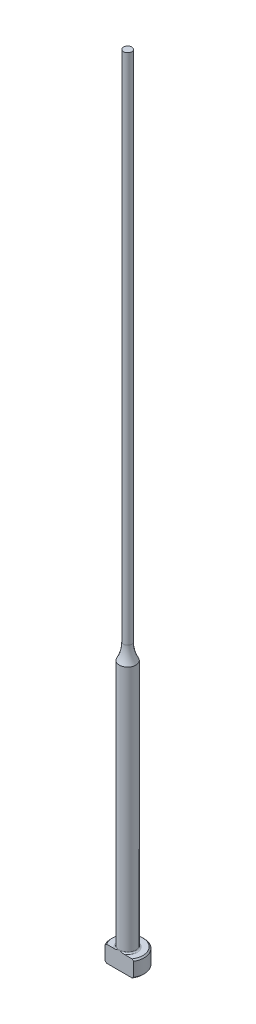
ISO-10303-21;
HEADER;
FILE_DESCRIPTION(('STEP AP214'),'2;1');
FILE_NAME('part.step','',(''),(''),'','','');
FILE_SCHEMA(('AUTOMOTIVE_DESIGN { 1 0 10303 214 1 1 1 1 }'));
ENDSEC;
DATA;
#1=APPLICATION_CONTEXT('core data for automotive mechanical design processes');
#2=APPLICATION_PROTOCOL_DEFINITION('international standard','automotive_design',2000,#1);
#3=PRODUCT_CONTEXT('',#1,'mechanical');
#4=PRODUCT('Part','Part','',(#3));
#5=PRODUCT_RELATED_PRODUCT_CATEGORY('part','',(#4));
#6=PRODUCT_DEFINITION_FORMATION('','',#4);
#7=PRODUCT_DEFINITION_CONTEXT('part definition',#1,'design');
#8=PRODUCT_DEFINITION('design','',#6,#7);
#9=PRODUCT_DEFINITION_SHAPE('','',#8);
#10=(LENGTH_UNIT() NAMED_UNIT(*) SI_UNIT(.MILLI.,.METRE.));
#11=(NAMED_UNIT(*) PLANE_ANGLE_UNIT() SI_UNIT($,.RADIAN.));
#12=(NAMED_UNIT(*) SI_UNIT($,.STERADIAN.) SOLID_ANGLE_UNIT());
#13=UNCERTAINTY_MEASURE_WITH_UNIT(LENGTH_MEASURE(1.E-05),#10,'distance_accuracy_value','');
#14=(GEOMETRIC_REPRESENTATION_CONTEXT(3) GLOBAL_UNCERTAINTY_ASSIGNED_CONTEXT((#13)) GLOBAL_UNIT_ASSIGNED_CONTEXT((#10,
#11,#12)) REPRESENTATION_CONTEXT('',''));
#15=CARTESIAN_POINT('',(0.,0.,0.));
#16=DIRECTION('',(0.,0.,1.));
#17=DIRECTION('',(1.,0.,0.));
#18=AXIS2_PLACEMENT_3D('',#15,#16,#17);
#19=CARTESIAN_POINT('',(-0.793749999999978,152.4,0.));
#20=DIRECTION('',(0.,1.,0.));
#21=DIRECTION('',(0.,0.,1.));
#22=AXIS2_PLACEMENT_3D('',#19,#20,#21);
#23=PLANE('',#22);
#24=CARTESIAN_POINT('',(0.,152.4,0.));
#25=DIRECTION('',(0.,1.,0.));
#26=DIRECTION('',(0.,0.,1.));
#27=AXIS2_PLACEMENT_3D('',#24,#25,#26);
#28=CIRCLE('',#27,0.793749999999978);
#29=CARTESIAN_POINT('',(0.,152.4,0.793749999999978));
#30=VERTEX_POINT('',#29);
#31=EDGE_CURVE('E169',#30,#30,#28,.T.);
#32=ORIENTED_EDGE('',*,*,#31,.T.);
#33=EDGE_LOOP('',(#32));
#34=FACE_BOUND('',#33,.T.);
#35=ADVANCED_FACE('F37',(#34),#23,.T.);
#36=CARTESIAN_POINT('',(0.,259.958771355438,0.));
#37=DIRECTION('',(0.,1.,0.));
#38=DIRECTION('',(0.,0.,1.));
#39=AXIS2_PLACEMENT_3D('',#36,#37,#38);
#40=CYLINDRICAL_SURFACE('',#39,0.793749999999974);
#41=CARTESIAN_POINT('',(0.,53.8741805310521,0.));
#42=DIRECTION('',(0.,1.,0.));
#43=DIRECTION('',(0.,0.,1.));
#44=AXIS2_PLACEMENT_3D('',#41,#42,#43);
#45=CIRCLE('',#44,0.79374999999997);
#46=CARTESIAN_POINT('',(0.,53.8741805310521,0.79374999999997));
#47=VERTEX_POINT('',#46);
#48=EDGE_CURVE('E172',#47,#47,#45,.T.);
#49=ORIENTED_EDGE('',*,*,#48,.T.);
#50=EDGE_LOOP('',(#49));
#51=FACE_BOUND('',#50,.T.);
#52=ORIENTED_EDGE('',*,*,#31,.F.);
#53=EDGE_LOOP('',(#52));
#54=FACE_BOUND('',#53,.T.);
#55=ADVANCED_FACE('F160',(#51,#54),#40,.T.);
#56=CARTESIAN_POINT('',(0.,53.8741805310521,0.));
#57=DIRECTION('',(0.,1.,0.));
#58=DIRECTION('',(0.,0.,1.));
#59=AXIS2_PLACEMENT_3D('',#56,#57,#58);
#60=TOROIDAL_SURFACE('',#59,7.14374999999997,6.35);
#61=CARTESIAN_POINT('',(0.,50.8,0.));
#62=DIRECTION('',(0.,1.,0.));
#63=DIRECTION('',(0.,0.,1.));
#64=AXIS2_PLACEMENT_3D('',#61,#62,#63);
#65=CIRCLE('',#64,1.58749999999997);
#66=CARTESIAN_POINT('',(0.,50.8,1.58749999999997));
#67=VERTEX_POINT('',#66);
#68=EDGE_CURVE('E100',#67,#67,#65,.T.);
#69=ORIENTED_EDGE('',*,*,#68,.T.);
#70=EDGE_LOOP('',(#69));
#71=FACE_BOUND('',#70,.T.);
#72=ORIENTED_EDGE('',*,*,#48,.F.);
#73=EDGE_LOOP('',(#72));
#74=FACE_BOUND('',#73,.T.);
#75=ADVANCED_FACE('F165',(#71,#74),#60,.F.);
#76=CARTESIAN_POINT('',(0.,259.958771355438,0.));
#77=DIRECTION('',(0.,1.,0.));
#78=DIRECTION('',(0.,0.,1.));
#79=AXIS2_PLACEMENT_3D('',#76,#77,#78);
#80=CYLINDRICAL_SURFACE('',#79,1.58749999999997);
#81=CARTESIAN_POINT('',(0.,3.42900000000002,0.));
#82=DIRECTION('',(0.,1.,0.));
#83=DIRECTION('',(0.,0.,1.));
#84=AXIS2_PLACEMENT_3D('',#81,#82,#83);
#85=CIRCLE('',#84,1.58749999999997);
#86=CARTESIAN_POINT('',(0.,3.42900000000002,1.58749999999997));
#87=VERTEX_POINT('',#86);
#88=EDGE_CURVE('E109',#87,#87,#85,.T.);
#89=ORIENTED_EDGE('',*,*,#88,.T.);
#90=EDGE_LOOP('',(#89));
#91=FACE_BOUND('',#90,.T.);
#92=ORIENTED_EDGE('',*,*,#68,.F.);
#93=EDGE_LOOP('',(#92));
#94=FACE_BOUND('',#93,.T.);
#95=ADVANCED_FACE('F192',(#91,#94),#80,.T.);
#96=CARTESIAN_POINT('',(-3.17499999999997,3.175,0.));
#97=DIRECTION('',(0.,1.,0.));
#98=DIRECTION('',(0.,0.,1.));
#99=AXIS2_PLACEMENT_3D('',#96,#97,#98);
#100=PLANE('',#99);
#101=DIRECTION('',(-1.,0.,0.));
#102=VECTOR('',#101,1.);
#103=CARTESIAN_POINT('',(-3.17499999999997,3.175,1.58749999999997));
#104=LINE('',#103,#102);
#105=CARTESIAN_POINT('',(2.45195529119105,3.175,1.58749999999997));
#106=VERTEX_POINT('',#105);
#107=CARTESIAN_POINT('',(0.933255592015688,3.175,1.58749999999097));
#108=VERTEX_POINT('',#107);
#109=EDGE_CURVE('E58',#106,#108,#104,.T.);
#110=ORIENTED_EDGE('',*,*,#109,.F.);
#111=CARTESIAN_POINT('',(0.,3.175,0.));
#112=DIRECTION('',(0.,1.,0.));
#113=DIRECTION('',(0.,0.,1.));
#114=AXIS2_PLACEMENT_3D('',#111,#112,#113);
#115=CIRCLE('',#114,2.92099999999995);
#116=CARTESIAN_POINT('',(-2.45195529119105,3.175,1.58749999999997));
#117=VERTEX_POINT('',#116);
#118=EDGE_CURVE('E171',#106,#117,#115,.T.);
#119=ORIENTED_EDGE('',*,*,#118,.T.);
#120=CARTESIAN_POINT('',(-0.933255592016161,3.17500000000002,1.58749999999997));
#121=VERTEX_POINT('',#120);
#122=EDGE_CURVE('E140',#121,#117,#104,.T.);
#123=ORIENTED_EDGE('',*,*,#122,.F.);
#124=CARTESIAN_POINT('',(0.,3.175,0.));
#125=DIRECTION('',(0.,1.,0.));
#126=DIRECTION('',(0.,0.,1.));
#127=AXIS2_PLACEMENT_3D('',#124,#125,#126);
#128=CIRCLE('',#127,1.84149999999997);
#129=EDGE_CURVE('E113',#121,#108,#128,.F.);
#130=ORIENTED_EDGE('',*,*,#129,.T.);
#131=EDGE_LOOP('',(#110,#119,#123,#130));
#132=FACE_BOUND('',#131,.T.);
#133=ADVANCED_FACE('F189',(#132),#100,.T.);
#134=CARTESIAN_POINT('',(0.,259.958771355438,0.));
#135=DIRECTION('',(0.,1.,0.));
#136=DIRECTION('',(0.,0.,1.));
#137=AXIS2_PLACEMENT_3D('',#134,#135,#136);
#138=CYLINDRICAL_SURFACE('',#137,3.17499999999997);
#139=DIRECTION('',(0.,-1.,0.));
#140=VECTOR('',#139,1.);
#141=CARTESIAN_POINT('',(-2.74963065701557,152.4,1.58749999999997));
#142=LINE('',#141,#140);
#143=CARTESIAN_POINT('',(-2.74963065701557,2.921,1.58749999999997));
#144=VERTEX_POINT('',#143);
#145=CARTESIAN_POINT('',(-2.74963065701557,0.254000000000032,1.58749999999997));
#146=VERTEX_POINT('',#145);
#147=EDGE_CURVE('E95',#144,#146,#142,.T.);
#148=ORIENTED_EDGE('',*,*,#147,.F.);
#149=CARTESIAN_POINT('',(0.,2.92100000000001,0.));
#150=DIRECTION('',(0.,1.,0.));
#151=DIRECTION('',(0.,0.,1.));
#152=AXIS2_PLACEMENT_3D('',#149,#150,#151);
#153=CIRCLE('',#152,3.17499999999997);
#154=CARTESIAN_POINT('',(2.74963065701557,2.921,1.58749999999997));
#155=VERTEX_POINT('',#154);
#156=EDGE_CURVE('E110',#144,#155,#153,.F.);
#157=ORIENTED_EDGE('',*,*,#156,.T.);
#158=DIRECTION('',(0.,-1.,0.));
#159=VECTOR('',#158,1.);
#160=CARTESIAN_POINT('',(2.74963065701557,152.4,1.58749999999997));
#161=LINE('',#160,#159);
#162=CARTESIAN_POINT('',(2.74963065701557,0.254000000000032,1.58749999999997));
#163=VERTEX_POINT('',#162);
#164=EDGE_CURVE('E182',#155,#163,#161,.T.);
#165=ORIENTED_EDGE('',*,*,#164,.T.);
#166=CARTESIAN_POINT('',(0.,0.254000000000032,0.));
#167=DIRECTION('',(0.,-1.,0.));
#168=DIRECTION('',(0.,0.,-1.));
#169=AXIS2_PLACEMENT_3D('',#166,#167,#168);
#170=CIRCLE('',#169,3.17499999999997);
#171=EDGE_CURVE('E116',#163,#146,#170,.F.);
#172=ORIENTED_EDGE('',*,*,#171,.T.);
#173=EDGE_LOOP('',(#148,#157,#165,#172));
#174=FACE_BOUND('',#173,.T.);
#175=ADVANCED_FACE('F180',(#174),#138,.T.);
#176=CARTESIAN_POINT('',(0.,0.,0.));
#177=DIRECTION('',(0.,-1.,0.));
#178=DIRECTION('',(0.,0.,-1.));
#179=AXIS2_PLACEMENT_3D('',#176,#177,#178);
#180=PLANE('',#179);
#181=DIRECTION('',(1.,0.,0.));
#182=VECTOR('',#181,1.);
#183=CARTESIAN_POINT('',(-2.74963065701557,0.,1.58749999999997));
#184=LINE('',#183,#182);
#185=CARTESIAN_POINT('',(-2.45195529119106,0.,1.58749999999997));
#186=VERTEX_POINT('',#185);
#187=CARTESIAN_POINT('',(2.45195529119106,0.,1.58749999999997));
#188=VERTEX_POINT('',#187);
#189=EDGE_CURVE('E92',#186,#188,#184,.T.);
#190=ORIENTED_EDGE('',*,*,#189,.F.);
#191=CARTESIAN_POINT('',(0.,0.,0.));
#192=DIRECTION('',(0.,-1.,0.));
#193=DIRECTION('',(0.,0.,-1.));
#194=AXIS2_PLACEMENT_3D('',#191,#192,#193);
#195=CIRCLE('',#194,2.92099999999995);
#196=EDGE_CURVE('E106',#186,#188,#195,.T.);
#197=ORIENTED_EDGE('',*,*,#196,.T.);
#198=EDGE_LOOP('',(#190,#197));
#199=FACE_BOUND('',#198,.T.);
#200=ADVANCED_FACE('F105',(#199),#180,.T.);
#201=CARTESIAN_POINT('',(0.,3.17499999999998,0.));
#202=DIRECTION('',(0.,-1.,0.));
#203=DIRECTION('',(0.,0.,-1.));
#204=AXIS2_PLACEMENT_3D('',#201,#202,#203);
#205=CONICAL_SURFACE('',#204,2.92099999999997,0.7853981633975);
#206=CARTESIAN_POINT('',(2.75033065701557,2.9203937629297,1.58749999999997));
#207=CARTESIAN_POINT('',(2.66887796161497,2.99091042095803,1.58749999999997));
#208=CARTESIAN_POINT('',(2.58705989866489,3.0610138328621,1.58749999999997));
#209=CARTESIAN_POINT('',(2.42241022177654,3.20009957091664,1.58749999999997));
#210=CARTESIAN_POINT('',(2.33957813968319,3.26908134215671,1.58749999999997));
#211=CARTESIAN_POINT('',(2.17073968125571,3.40716024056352,1.58749999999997));
#212=CARTESIAN_POINT('',(2.08470440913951,3.47622217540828,1.58749999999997));
#213=CARTESIAN_POINT('',(1.91099881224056,3.61222325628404,1.58749999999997));
#214=CARTESIAN_POINT('',(1.82332890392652,3.67916293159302,1.58749999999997));
#215=CARTESIAN_POINT('',(1.64569223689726,3.81020667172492,1.58749999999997));
#216=CARTESIAN_POINT('',(1.55572245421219,3.87430666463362,1.58749999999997));
#217=CARTESIAN_POINT('',(1.37280394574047,3.99833089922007,1.58749999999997));
#218=CARTESIAN_POINT('',(1.27985285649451,4.05825170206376,1.58749999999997));
#219=CARTESIAN_POINT('',(1.09086561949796,4.17130826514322,1.58749999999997));
#220=CARTESIAN_POINT('',(0.99485990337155,4.22449421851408,1.58749999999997));
#221=CARTESIAN_POINT('',(0.798114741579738,4.32122233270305,1.58749999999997));
#222=CARTESIAN_POINT('',(0.697384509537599,4.36478238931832,1.58749999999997));
#223=CARTESIAN_POINT('',(0.541185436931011,4.4195165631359,1.58749999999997));
#224=CARTESIAN_POINT('',(0.487627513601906,4.43611950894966,1.58749999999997));
#225=CARTESIAN_POINT('',(0.379267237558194,4.46466012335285,1.58749999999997));
#226=CARTESIAN_POINT('',(0.324465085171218,4.47659853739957,1.58749999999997));
#227=CARTESIAN_POINT('',(0.214272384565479,4.49501904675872,1.58749999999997));
#228=CARTESIAN_POINT('',(0.158887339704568,4.50153345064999,1.58749999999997));
#229=CARTESIAN_POINT('',(0.0477364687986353,4.50875028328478,1.58749999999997));
#230=CARTESIAN_POINT('',(-0.00802931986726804,4.50945327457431,1.58749999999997));
#231=CARTESIAN_POINT('',(-0.119372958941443,4.50499163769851,1.58749999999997));
#232=CARTESIAN_POINT('',(-0.174950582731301,4.49982147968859,1.58749999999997));
#233=CARTESIAN_POINT('',(-0.285312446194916,4.48399101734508,1.58749999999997));
#234=CARTESIAN_POINT('',(-0.340096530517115,4.47332965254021,1.58749999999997));
#235=CARTESIAN_POINT('',(-0.448865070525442,4.44711334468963,1.58749999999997));
#236=CARTESIAN_POINT('',(-0.50284128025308,4.43152477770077,1.58749999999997));
#237=CARTESIAN_POINT('',(-0.609429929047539,4.39628553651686,1.58749999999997));
#238=CARTESIAN_POINT('',(-0.66204236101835,4.3766348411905,1.58749999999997));
#239=CARTESIAN_POINT('',(-0.778129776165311,4.32902110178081,1.58749999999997));
#240=CARTESIAN_POINT('',(-0.84124591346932,4.30019026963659,1.58749999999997));
#241=CARTESIAN_POINT('',(-0.965594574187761,4.23868811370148,1.58749999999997));
#242=CARTESIAN_POINT('',(-1.02682597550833,4.20601455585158,1.58749999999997));
#243=CARTESIAN_POINT('',(-1.14774341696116,4.13769010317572,1.58749999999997));
#244=CARTESIAN_POINT('',(-1.20742632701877,4.10203371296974,1.58749999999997));
#245=CARTESIAN_POINT('',(-1.32539130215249,4.02846531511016,1.58749999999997));
#246=CARTESIAN_POINT('',(-1.38367308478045,3.9905528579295,1.58749999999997));
#247=CARTESIAN_POINT('',(-1.55734442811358,3.87382704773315,1.58749999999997));
#248=CARTESIAN_POINT('',(-1.67095842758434,3.79237897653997,1.58749999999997));
#249=CARTESIAN_POINT('',(-1.8947523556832,3.6252186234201,1.58749999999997));
#250=CARTESIAN_POINT('',(-2.00493591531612,3.53951111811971,1.58749999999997));
#251=CARTESIAN_POINT('',(-2.22248693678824,3.3655494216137,1.58749999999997));
#252=CARTESIAN_POINT('',(-2.32986450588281,3.27730782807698,1.58749999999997));
#253=CARTESIAN_POINT('',(-2.48909538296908,3.14389342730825,1.58749999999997));
#254=CARTESIAN_POINT('',(-2.54159338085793,3.09948435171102,1.58749999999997));
#255=CARTESIAN_POINT('',(-2.64622282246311,3.01024124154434,1.58749999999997));
#256=CARTESIAN_POINT('',(-2.69835428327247,2.96540722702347,1.58749999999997));
#257=CARTESIAN_POINT('',(-2.75033065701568,2.92039376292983,1.58749999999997));
#258=B_SPLINE_CURVE_WITH_KNOTS('',3,(#206,#207,#208,#209,#210,#211,#212,#213,#214,#215,#216,
#217,#218,#219,#220,#221,#222,#223,#224,#225,#226,#227,#228,#229,#230,#231,#232,#233,#234,#235,
#236,#237,#238,#239,#240,#241,#242,#243,#244,#245,#246,#247,#248,#249,#250,#251,#252,#253,#254,
#255,#256,#257),.UNSPECIFIED.,.F.,.F.,(4,2,2,2,2,2,2,2,2,2,2,2,2,2,2,2,2,2,2,2,2,2,2,2,2,4),(0.,
0.323216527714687,0.64658837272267,0.977539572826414,1.30840757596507,1.63973560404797,
1.97133312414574,2.30029221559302,2.62863448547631,2.79668277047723,2.9647041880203,
3.13171746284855,3.29871457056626,3.46586904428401,3.63305581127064,3.80140905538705,
3.96976317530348,4.17775353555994,4.38586541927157,4.59436953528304,4.80291533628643,
5.22209642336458,5.64081759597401,6.0577303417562,6.26401477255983,6.47028951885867),.UNSPECIFIED.);
#259=EDGE_CURVE('E63',#155,#106,#258,.T.);
#260=ORIENTED_EDGE('',*,*,#259,.F.);
#261=ORIENTED_EDGE('',*,*,#156,.F.);
#262=EDGE_CURVE('E133',#117,#144,#258,.T.);
#263=ORIENTED_EDGE('',*,*,#262,.F.);
#264=ORIENTED_EDGE('',*,*,#118,.F.);
#265=EDGE_LOOP('',(#260,#261,#263,#264));
#266=FACE_BOUND('',#265,.T.);
#267=ADVANCED_FACE('F147',(#266),#205,.T.);
#268=CARTESIAN_POINT('',(0.,0.254000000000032,0.));
#269=DIRECTION('',(0.,1.,0.));
#270=DIRECTION('',(0.,0.,1.));
#271=AXIS2_PLACEMENT_3D('',#268,#269,#270);
#272=CONICAL_SURFACE('',#271,3.17499999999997,0.785398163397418);
#273=CARTESIAN_POINT('',(-2.75033065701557,0.254606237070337,1.58749999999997));
#274=CARTESIAN_POINT('',(-2.66887796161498,0.184089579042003,1.58749999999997));
#275=CARTESIAN_POINT('',(-2.58705989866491,0.113986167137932,1.58749999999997));
#276=CARTESIAN_POINT('',(-2.42241022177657,-0.0250995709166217,1.58749999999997));
#277=CARTESIAN_POINT('',(-2.33957813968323,-0.0940813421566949,1.58749999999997));
#278=CARTESIAN_POINT('',(-2.17073968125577,-0.232160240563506,1.58749999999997));
#279=CARTESIAN_POINT('',(-2.08470440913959,-0.301222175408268,1.58749999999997));
#280=CARTESIAN_POINT('',(-1.91099881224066,-0.437223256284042,1.58749999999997));
#281=CARTESIAN_POINT('',(-1.82332890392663,-0.504162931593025,1.58749999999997));
#282=CARTESIAN_POINT('',(-1.64569223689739,-0.635206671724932,1.58749999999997));
#283=CARTESIAN_POINT('',(-1.55572245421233,-0.699306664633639,1.58749999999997));
#284=CARTESIAN_POINT('',(-1.37280394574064,-0.8233308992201,1.58749999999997));
#285=CARTESIAN_POINT('',(-1.27985285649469,-0.883251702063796,1.58749999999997));
#286=CARTESIAN_POINT('',(-1.09086561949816,-0.996308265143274,1.58749999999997));
#287=CARTESIAN_POINT('',(-0.994859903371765,-1.04949421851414,1.58749999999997));
#288=CARTESIAN_POINT('',(-0.798114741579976,-1.14622233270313,1.58749999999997));
#289=CARTESIAN_POINT('',(-0.697384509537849,-1.18978238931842,1.58749999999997));
#290=CARTESIAN_POINT('',(-0.54118543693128,-1.24451656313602,1.58749999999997));
#291=CARTESIAN_POINT('',(-0.487627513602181,-1.26111950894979,1.58749999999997));
#292=CARTESIAN_POINT('',(-0.379267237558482,-1.28966012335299,1.58749999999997));
#293=CARTESIAN_POINT('',(-0.324465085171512,-1.30159853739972,1.58749999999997));
#294=CARTESIAN_POINT('',(-0.214272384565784,-1.3200190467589,1.58749999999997));
#295=CARTESIAN_POINT('',(-0.158887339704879,-1.32653345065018,1.58749999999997));
#296=CARTESIAN_POINT('',(-0.0477364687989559,-1.33375028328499,1.58749999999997));
#297=CARTESIAN_POINT('',(0.00802931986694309,-1.33445327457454,1.58749999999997));
#298=CARTESIAN_POINT('',(0.119372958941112,-1.32999163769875,1.58749999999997));
#299=CARTESIAN_POINT('',(0.174950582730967,-1.32482147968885,1.58749999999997));
#300=CARTESIAN_POINT('',(0.28531244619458,-1.30899101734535,1.58749999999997));
#301=CARTESIAN_POINT('',(0.340096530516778,-1.2983296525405,1.58749999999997));
#302=CARTESIAN_POINT('',(0.448865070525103,-1.27211334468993,1.58749999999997));
#303=CARTESIAN_POINT('',(0.50284128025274,-1.25652477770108,1.58749999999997));
#304=CARTESIAN_POINT('',(0.609429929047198,-1.22128553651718,1.58749999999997));
#305=CARTESIAN_POINT('',(0.662042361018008,-1.20163484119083,1.58749999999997));
#306=CARTESIAN_POINT('',(0.778129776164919,-1.15402110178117,1.58749999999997));
#307=CARTESIAN_POINT('',(0.84124591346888,-1.12519026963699,1.58749999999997));
#308=CARTESIAN_POINT('',(0.965594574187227,-1.06368811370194,1.58749999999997));
#309=CARTESIAN_POINT('',(1.02682597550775,-1.03101455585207,1.58749999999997));
#310=CARTESIAN_POINT('',(1.14774341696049,-0.962690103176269,1.58749999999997));
#311=CARTESIAN_POINT('',(1.20742632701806,-0.927033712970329,1.58749999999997));
#312=CARTESIAN_POINT('',(1.32539130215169,-0.853465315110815,1.58749999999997));
#313=CARTESIAN_POINT('',(1.38367308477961,-0.815552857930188,1.58749999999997));
#314=CARTESIAN_POINT('',(1.5573444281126,-0.698827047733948,1.58749999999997));
#315=CARTESIAN_POINT('',(1.67095842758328,-0.617378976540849,1.58749999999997));
#316=CARTESIAN_POINT('',(1.89475235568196,-0.450218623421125,1.58749999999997));
#317=CARTESIAN_POINT('',(2.0049359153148,-0.364511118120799,1.58749999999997));
#318=CARTESIAN_POINT('',(2.22248693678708,-0.190549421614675,1.58749999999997));
#319=CARTESIAN_POINT('',(2.32986450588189,-0.102307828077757,1.58749999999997));
#320=CARTESIAN_POINT('',(2.48909538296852,0.0311065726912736,1.58749999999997));
#321=CARTESIAN_POINT('',(2.54159338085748,0.0755156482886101,1.58749999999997));
#322=CARTESIAN_POINT('',(2.64622282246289,0.164758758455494,1.58749999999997));
#323=CARTESIAN_POINT('',(2.69835428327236,0.20959277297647,1.58749999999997));
#324=CARTESIAN_POINT('',(2.75033065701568,0.25460623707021,1.58749999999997));
#325=B_SPLINE_CURVE_WITH_KNOTS('',3,(#273,#274,#275,#276,#277,#278,#279,#280,#281,#282,#283,
#284,#285,#286,#287,#288,#289,#290,#291,#292,#293,#294,#295,#296,#297,#298,#299,#300,#301,#302,
#303,#304,#305,#306,#307,#308,#309,#310,#311,#312,#313,#314,#315,#316,#317,#318,#319,#320,#321,
#322,#323,#324),.UNSPECIFIED.,.F.,.F.,(4,2,2,2,2,2,2,2,2,2,2,2,2,2,2,2,2,2,2,2,2,2,2,2,2,4),(0.,
0.323216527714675,0.646588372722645,0.977539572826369,1.308407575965,1.63973560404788,
1.97133312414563,2.3002922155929,2.62863448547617,2.79668277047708,2.96470418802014,
3.13171746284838,3.29871457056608,3.46586904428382,3.63305581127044,3.80140905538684,
3.96976317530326,4.17775353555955,4.38586541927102,4.59436953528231,4.80291533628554,
5.22209642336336,5.64081759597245,6.05773034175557,6.26401477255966,6.47028951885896),.UNSPECIFIED.);
#326=EDGE_CURVE('E89',#146,#186,#325,.T.);
#327=ORIENTED_EDGE('',*,*,#326,.F.);
#328=ORIENTED_EDGE('',*,*,#171,.F.);
#329=EDGE_CURVE('E101',#188,#163,#325,.T.);
#330=ORIENTED_EDGE('',*,*,#329,.F.);
#331=ORIENTED_EDGE('',*,*,#196,.F.);
#332=EDGE_LOOP('',(#327,#328,#330,#331));
#333=FACE_BOUND('',#332,.T.);
#334=ADVANCED_FACE('F108',(#333),#272,.T.);
#335=CARTESIAN_POINT('',(0.,3.42900000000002,0.));
#336=DIRECTION('',(0.,1.,0.));
#337=DIRECTION('',(0.,0.,1.));
#338=AXIS2_PLACEMENT_3D('',#335,#336,#337);
#339=TOROIDAL_SURFACE('',#338,1.84149999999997,0.254);
#340=ORIENTED_EDGE('',*,*,#129,.F.);
#341=CARTESIAN_POINT('',(0.,3.42900000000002,1.58749999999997));
#342=CARTESIAN_POINT('',(-1.9220500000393E-10,3.42900057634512,1.58749999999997));
#343=CARTESIAN_POINT('',(-1.22611614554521E-07,3.42900115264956,1.58749999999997));
#344=CARTESIAN_POINT('',(-5.09676364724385E-07,3.42900226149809,1.58749999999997));
#345=CARTESIAN_POINT('',(-7.78176327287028E-07,3.42900279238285,1.58749999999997));
#346=CARTESIAN_POINT('',(-1.42307272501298E-06,3.42900385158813,1.58749999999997));
#347=CARTESIAN_POINT('',(-1.80713867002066E-06,3.42900437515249,1.58749999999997));
#348=CARTESIAN_POINT('',(-2.63494846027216E-06,3.42900536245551,1.58749999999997));
#349=CARTESIAN_POINT('',(-3.07814756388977E-06,3.42900582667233,1.58749999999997));
#350=CARTESIAN_POINT('',(-4.66897357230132E-06,3.42900738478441,1.58749999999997));
#351=CARTESIAN_POINT('',(-5.89404907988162E-06,3.42900840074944,1.58749999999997));
#352=CARTESIAN_POINT('',(-8.42427510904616E-06,3.42901020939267,1.58749999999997));
#353=CARTESIAN_POINT('',(-9.72480574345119E-06,3.42901100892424,1.58749999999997));
#354=CARTESIAN_POINT('',(-1.48060601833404E-05,3.42901401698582,1.58749999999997));
#355=CARTESIAN_POINT('',(-1.86838281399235E-05,3.42901606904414,1.58749999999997));
#356=CARTESIAN_POINT('',(-2.63261117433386E-05,3.42901942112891,1.58749999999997));
#357=CARTESIAN_POINT('',(-3.0068741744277E-05,3.42902077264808,1.58749999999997));
#358=CARTESIAN_POINT('',(-4.60276298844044E-05,3.42902652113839,1.58749999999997));
#359=CARTESIAN_POINT('',(-5.82470198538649E-05,3.42903088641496,1.58749999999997));
#360=CARTESIAN_POINT('',(-8.11070097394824E-05,3.42903788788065,1.58749999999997));
#361=CARTESIAN_POINT('',(-9.16953114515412E-05,3.42904068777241,1.58749999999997));
#362=CARTESIAN_POINT('',(-0.000168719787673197,3.42906287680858,1.58749999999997));
#363=CARTESIAN_POINT('',(-0.000232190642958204,3.4290911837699,1.58749999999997));
#364=CARTESIAN_POINT('',(-0.000479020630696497,3.42919723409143,1.58749999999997));
#365=CARTESIAN_POINT('',(-0.000664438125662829,3.42926834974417,1.58749999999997));
#366=CARTESIAN_POINT('',(-0.0013844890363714,3.42954862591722,1.58749999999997));
#367=CARTESIAN_POINT('',(-0.00191701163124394,3.42976473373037,1.58749999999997));
#368=CARTESIAN_POINT('',(-0.00409774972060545,3.4306455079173,1.58749999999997));
#369=CARTESIAN_POINT('',(-0.00574830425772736,3.43130231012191,1.58749999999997));
#370=CARTESIAN_POINT('',(-0.0289985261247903,3.4405594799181,1.58749999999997));
#371=CARTESIAN_POINT('',(-0.0505816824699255,3.4492167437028,1.58749999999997));
#372=CARTESIAN_POINT('',(-0.0929947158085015,3.46610702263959,1.58749999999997));
#373=CARTESIAN_POINT('',(-0.113823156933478,3.47434394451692,1.58749999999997));
#374=CARTESIAN_POINT('',(-0.157956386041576,3.49164606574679,1.58749999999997));
#375=CARTESIAN_POINT('',(-0.181267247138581,3.50069608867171,1.58749999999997));
#376=CARTESIAN_POINT('',(-0.228222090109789,3.51863224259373,1.58749999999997));
#377=CARTESIAN_POINT('',(-0.25186705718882,3.52751579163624,1.58749999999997));
#378=CARTESIAN_POINT('',(-0.310512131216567,3.54905503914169,1.58749999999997));
#379=CARTESIAN_POINT('',(-0.345588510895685,3.56150550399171,1.58749999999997));
#380=CARTESIAN_POINT('',(-0.415278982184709,3.5850302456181,1.58749999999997));
#381=CARTESIAN_POINT('',(-0.449884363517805,3.59613012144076,1.58749999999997));
#382=CARTESIAN_POINT('',(-0.524471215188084,3.61841679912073,1.58749999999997));
#383=CARTESIAN_POINT('',(-0.564517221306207,3.62939137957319,1.58749999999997));
#384=CARTESIAN_POINT('',(-0.645529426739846,3.6489746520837,1.58749999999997));
#385=CARTESIAN_POINT('',(-0.686500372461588,3.65756417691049,1.58749999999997));
#386=CARTESIAN_POINT('',(-0.771546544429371,3.67188287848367,1.58749999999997));
#387=CARTESIAN_POINT('',(-0.815658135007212,3.67740449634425,1.58749999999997));
#388=CARTESIAN_POINT('',(-0.904117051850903,3.68344603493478,1.58749999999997));
#389=CARTESIAN_POINT('',(-0.948462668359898,3.68398638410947,1.58749999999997));
#390=CARTESIAN_POINT('',(-1.02531896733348,3.67901051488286,1.58749999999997));
#391=CARTESIAN_POINT('',(-1.05792141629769,3.67502604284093,1.58749999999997));
#392=CARTESIAN_POINT('',(-1.12184393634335,3.66230832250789,1.58749999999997));
#393=CARTESIAN_POINT('',(-1.1531753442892,3.65363950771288,1.58749999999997));
#394=CARTESIAN_POINT('',(-1.19946468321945,3.6356384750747,1.58749999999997));
#395=CARTESIAN_POINT('',(-1.21526783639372,3.62848492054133,1.58749999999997));
#396=CARTESIAN_POINT('',(-1.24583726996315,3.61212937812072,1.58749999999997));
#397=CARTESIAN_POINT('',(-1.26060215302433,3.60292469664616,1.58749999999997));
#398=CARTESIAN_POINT('',(-1.28575815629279,3.58421518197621,1.58749999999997));
#399=CARTESIAN_POINT('',(-1.29644383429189,3.57510998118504,1.58749999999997));
#400=CARTESIAN_POINT('',(-1.31623154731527,3.55531539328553,1.58749999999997));
#401=CARTESIAN_POINT('',(-1.32533681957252,3.54462932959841,1.58749999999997));
#402=CARTESIAN_POINT('',(-1.33941140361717,3.52450022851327,1.58749999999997));
#403=CARTESIAN_POINT('',(-1.34484814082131,3.51538553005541,1.58749999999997));
#404=CARTESIAN_POINT('',(-1.35416329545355,3.49638544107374,1.58749999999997));
#405=CARTESIAN_POINT('',(-1.35804267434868,3.48650053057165,1.58749999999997));
#406=CARTESIAN_POINT('',(-1.36398436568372,3.46611321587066,1.58749999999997));
#407=CARTESIAN_POINT('',(-1.36603350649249,3.45560690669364,1.58749999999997));
#408=CARTESIAN_POINT('',(-1.3680840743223,3.43439627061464,1.58749999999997));
#409=CARTESIAN_POINT('',(-1.36808648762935,3.42369204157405,1.58749999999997));
#410=CARTESIAN_POINT('',(-1.36616208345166,3.40366716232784,1.58749999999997));
#411=CARTESIAN_POINT('',(-1.36444960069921,3.39432493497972,1.58749999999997));
#412=CARTESIAN_POINT('',(-1.35953338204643,3.37604480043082,1.58749999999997));
#413=CARTESIAN_POINT('',(-1.3563294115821,3.36710695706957,1.58749999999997));
#414=CARTESIAN_POINT('',(-1.34848006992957,3.34949697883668,1.58749999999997));
#415=CARTESIAN_POINT('',(-1.34378578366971,3.34084688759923,1.58749999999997));
#416=CARTESIAN_POINT('',(-1.33324445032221,3.32428742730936,1.58749999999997));
#417=CARTESIAN_POINT('',(-1.32739692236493,3.31637836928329,1.58749999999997));
#418=CARTESIAN_POINT('',(-1.31107304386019,3.29692878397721,1.58749999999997));
#419=CARTESIAN_POINT('',(-1.29989286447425,3.28597778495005,1.58749999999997));
#420=CARTESIAN_POINT('',(-1.27593566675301,3.26597490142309,1.58749999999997));
#421=CARTESIAN_POINT('',(-1.2631537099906,3.25692913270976,1.58749999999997));
#422=CARTESIAN_POINT('',(-1.22930733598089,3.23613976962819,1.58749999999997));
#423=CARTESIAN_POINT('',(-1.20751096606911,3.22559415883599,1.58749999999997));
#424=CARTESIAN_POINT('',(-1.16266144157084,3.20795356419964,1.58749999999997));
#425=CARTESIAN_POINT('',(-1.13960937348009,3.20085564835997,1.58749999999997));
#426=CARTESIAN_POINT('',(-1.07603916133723,3.18534571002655,1.58749999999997));
#427=CARTESIAN_POINT('',(-1.03486686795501,3.17965078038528,1.58749999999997));
#428=CARTESIAN_POINT('',(-0.951558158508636,3.1741711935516,1.58749999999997));
#429=CARTESIAN_POINT('',(-0.909417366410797,3.17449023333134,1.58749999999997));
#430=CARTESIAN_POINT('',(-0.811383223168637,3.18054602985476,1.58749999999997));
#431=CARTESIAN_POINT('',(-0.755610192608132,3.18806126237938,1.58749999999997));
#432=CARTESIAN_POINT('',(-0.644937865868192,3.20866626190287,1.58749999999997));
#433=CARTESIAN_POINT('',(-0.590043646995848,3.2217810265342,1.58749999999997));
#434=CARTESIAN_POINT('',(-0.485757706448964,3.25059077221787,1.58749999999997));
#435=CARTESIAN_POINT('',(-0.436281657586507,3.2659890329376,1.58749999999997));
#436=CARTESIAN_POINT('',(-0.338551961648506,3.29877502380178,1.58749999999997));
#437=CARTESIAN_POINT('',(-0.290291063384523,3.31614156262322,1.58749999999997));
#438=CARTESIAN_POINT('',(-0.225557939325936,3.34039762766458,1.58749999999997));
#439=CARTESIAN_POINT('',(-0.208874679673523,3.34673586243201,1.58749999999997));
#440=CARTESIAN_POINT('',(-0.175123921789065,3.35969957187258,1.58749999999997));
#441=CARTESIAN_POINT('',(-0.158057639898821,3.36632823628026,1.58749999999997));
#442=CARTESIAN_POINT('',(-0.117638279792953,3.38214476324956,1.58749999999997));
#443=CARTESIAN_POINT('',(-0.0943002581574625,3.39137029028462,1.58749999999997));
#444=CARTESIAN_POINT('',(-0.049782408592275,3.40910304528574,1.58749999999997));
#445=CARTESIAN_POINT('',(-0.028598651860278,3.41759960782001,1.58749999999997));
#446=CARTESIAN_POINT('',(-0.00575168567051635,3.42669635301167,1.58749999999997));
#447=CARTESIAN_POINT('',(-0.00410451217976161,3.42735181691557,1.58749999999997));
#448=CARTESIAN_POINT('',(-0.00192459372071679,3.42823223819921,1.58749999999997));
#449=CARTESIAN_POINT('',(-0.00138952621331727,3.42844937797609,1.58749999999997));
#450=CARTESIAN_POINT('',(-0.000666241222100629,3.42873091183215,1.58749999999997));
#451=CARTESIAN_POINT('',(-0.000480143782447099,3.42880228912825,1.58749999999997));
#452=CARTESIAN_POINT('',(-0.000232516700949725,3.4289086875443,1.58749999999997));
#453=CARTESIAN_POINT('',(-0.00016892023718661,3.42893705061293,1.58749999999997));
#454=CARTESIAN_POINT('',(-9.17527161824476E-05,3.42895927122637,1.58749999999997));
#455=CARTESIAN_POINT('',(-8.11550293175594E-05,3.42896207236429,1.58749999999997));
#456=CARTESIAN_POINT('',(-5.82743948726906E-05,3.4289690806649,1.58749999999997));
#457=CARTESIAN_POINT('',(-4.60440001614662E-05,3.4289734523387,1.58749999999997));
#458=CARTESIAN_POINT('',(-3.00727682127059E-05,3.42897920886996,1.58749999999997));
#459=CARTESIAN_POINT('',(-2.63286807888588E-05,3.42898056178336,1.58749999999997));
#460=CARTESIAN_POINT('',(-1.86836529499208E-05,3.42898391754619,1.58749999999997));
#461=CARTESIAN_POINT('',(-1.48046517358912E-05,3.42898597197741,1.58749999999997));
#462=CARTESIAN_POINT('',(-9.72223943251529E-06,3.42898898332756,1.58749999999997));
#463=CARTESIAN_POINT('',(-8.4215964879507E-06,3.4289897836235,1.58749999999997));
#464=CARTESIAN_POINT('',(-5.89129728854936E-06,3.428991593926,1.58749999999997));
#465=CARTESIAN_POINT('',(-4.66626866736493E-06,3.42899261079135,1.58749999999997));
#466=CARTESIAN_POINT('',(-3.07568803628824E-06,3.42899417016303,1.58749999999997));
#467=CARTESIAN_POINT('',(-2.63259565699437E-06,3.42899463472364,1.58749999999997));
#468=CARTESIAN_POINT('',(-1.80506085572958E-06,3.42899562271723,1.58749999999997));
#469=CARTESIAN_POINT('',(-1.42116387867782E-06,3.4289961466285,1.58749999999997));
#470=CARTESIAN_POINT('',(-7.76675642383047E-07,3.42899720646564,1.58749999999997));
#471=CARTESIAN_POINT('',(-5.08406487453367E-07,3.42899773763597,1.58749999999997));
#472=CARTESIAN_POINT('',(-1.21901887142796E-07,3.42899884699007,1.58749999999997));
#473=CARTESIAN_POINT('',(1.92251529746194E-10,3.42899942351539,1.58749999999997));
#474=CARTESIAN_POINT('',(0.,3.42900000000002,1.58749999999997));
#475=B_SPLINE_CURVE_WITH_KNOTS('',3,(#341,#342,#343,#344,#345,#346,#347,#348,#349,#350,#351,
#352,#353,#354,#355,#356,#357,#358,#359,#360,#361,#362,#363,#364,#365,#366,#367,#368,#369,#370,
#371,#372,#373,#374,#375,#376,#377,#378,#379,#380,#381,#382,#383,#384,#385,#386,#387,#388,#389,
#390,#391,#392,#393,#394,#395,#396,#397,#398,#399,#400,#401,#402,#403,#404,#405,#406,#407,#408,
#409,#410,#411,#412,#413,#414,#415,#416,#417,#418,#419,#420,#421,#422,#423,#424,#425,#426,#427,
#428,#429,#430,#431,#432,#433,#434,#435,#436,#437,#438,#439,#440,#441,#442,#443,#444,#445,#446,
#447,#448,#449,#450,#451,#452,#453,#454,#455,#456,#457,#458,#459,#460,#461,#462,#463,#464,#465,
#466,#467,#468,#469,#470,#471,#472,#473,#474),.UNSPECIFIED.,.T.,.F.,(4,2,2,2,2,2,2,2,2,2,2,2,2,
2,2,2,2,2,2,2,2,2,2,2,2,2,2,2,2,2,2,2,2,2,2,2,2,2,2,2,2,2,2,2,2,2,2,2,2,2,2,2,2,2,2,2,2,2,2,2,2,
2,2,2,2,2,4),(0.,1.72815459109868E-06,3.50429256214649E-06,5.44431005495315E-06,
7.36755250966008E-06,1.21190896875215E-05,1.66953775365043E-05,2.98160400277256E-05,
4.17409564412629E-05,8.06604753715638E-05,0.000113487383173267,0.000321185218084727,
0.000917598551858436,0.00264089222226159,0.00797105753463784,0.0777276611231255,
0.144923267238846,0.219939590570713,0.295714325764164,0.407362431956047,0.516367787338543,
0.640878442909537,0.766362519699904,0.899536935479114,1.03216495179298,1.130457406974,
1.22743103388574,1.27935899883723,1.33135556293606,1.3733324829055,1.41522237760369,
1.44693946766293,1.47863694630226,1.51056074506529,1.54246916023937,1.57083210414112,
1.59919951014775,1.62861579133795,1.65804436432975,1.70472658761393,1.75155645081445,
1.82378709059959,1.89595619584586,2.01995471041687,2.14609321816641,2.31447224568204,
2.4836109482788,2.63898919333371,2.79283011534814,2.8463703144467,2.90129461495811,
2.9765823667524,3.04504771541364,3.05036697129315,3.0520984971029,3.0526970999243,
3.05290520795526,3.05293806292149,3.05297701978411,3.05298895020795,3.05300207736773,
3.05300665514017,3.05301140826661,3.0530133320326,3.05301527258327,3.05301704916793,
3.05301877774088),.UNSPECIFIED.);
#476=EDGE_CURVE('E11',#121,#87,#475,.T.);
#477=ORIENTED_EDGE('',*,*,#476,.T.);
#478=ORIENTED_EDGE('',*,*,#88,.F.);
#479=CARTESIAN_POINT('',(0.,3.42900000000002,1.58749999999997));
#480=CARTESIAN_POINT('',(1.92205030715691E-10,3.42899942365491,1.58749999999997));
#481=CARTESIAN_POINT('',(1.22611614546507E-07,3.42899884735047,1.58749999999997));
#482=CARTESIAN_POINT('',(5.09676364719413E-07,3.42899773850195,1.58749999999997));
#483=CARTESIAN_POINT('',(7.78176327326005E-07,3.42899720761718,1.58749999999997));
#484=CARTESIAN_POINT('',(1.42307272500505E-06,3.4289961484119,1.58749999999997));
#485=CARTESIAN_POINT('',(1.80713866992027E-06,3.42899562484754,1.58749999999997));
#486=CARTESIAN_POINT('',(2.63494846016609E-06,3.42899463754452,1.58749999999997));
#487=CARTESIAN_POINT('',(3.07814756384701E-06,3.4289941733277,1.58749999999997));
#488=CARTESIAN_POINT('',(4.66897357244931E-06,3.42899261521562,1.58749999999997));
#489=CARTESIAN_POINT('',(5.89404907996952E-06,3.42899159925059,1.58749999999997));
#490=CARTESIAN_POINT('',(8.42427510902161E-06,3.42898979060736,1.58749999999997));
#491=CARTESIAN_POINT('',(9.72480574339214E-06,3.42898899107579,1.58749999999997));
#492=CARTESIAN_POINT('',(1.48060601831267E-05,3.42898598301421,1.58749999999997));
#493=CARTESIAN_POINT('',(1.86838281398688E-05,3.42898393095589,1.58749999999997));
#494=CARTESIAN_POINT('',(2.63261117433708E-05,3.42898057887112,1.58749999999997));
#495=CARTESIAN_POINT('',(3.00687417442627E-05,3.42897922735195,1.58749999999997));
#496=CARTESIAN_POINT('',(4.6027629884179E-05,3.42897347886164,1.58749999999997));
#497=CARTESIAN_POINT('',(5.82470198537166E-05,3.42896911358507,1.58749999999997));
#498=CARTESIAN_POINT('',(8.1107009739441E-05,3.42896211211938,1.58749999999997));
#499=CARTESIAN_POINT('',(9.16953114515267E-05,3.42895931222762,1.58749999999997));
#500=CARTESIAN_POINT('',(0.00016871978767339,3.42893712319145,1.58749999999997));
#501=CARTESIAN_POINT('',(0.000232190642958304,3.42890881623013,1.58749999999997));
#502=CARTESIAN_POINT('',(0.000479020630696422,3.4288027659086,1.58749999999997));
#503=CARTESIAN_POINT('',(0.000664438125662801,3.42873165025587,1.58749999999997));
#504=CARTESIAN_POINT('',(0.0013844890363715,3.42845137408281,1.58749999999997));
#505=CARTESIAN_POINT('',(0.00191701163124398,3.42823526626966,1.58749999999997));
#506=CARTESIAN_POINT('',(0.00409774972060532,3.42735449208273,1.58749999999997));
#507=CARTESIAN_POINT('',(0.0057483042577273,3.42669768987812,1.58749999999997));
#508=CARTESIAN_POINT('',(0.028998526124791,3.41744052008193,1.58749999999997));
#509=CARTESIAN_POINT('',(0.0505816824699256,3.40878325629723,1.58749999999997));
#510=CARTESIAN_POINT('',(0.0929947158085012,3.39189297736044,1.58749999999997));
#511=CARTESIAN_POINT('',(0.113823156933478,3.38365605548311,1.58749999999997));
#512=CARTESIAN_POINT('',(0.157956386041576,3.36635393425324,1.58749999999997));
#513=CARTESIAN_POINT('',(0.181267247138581,3.35730391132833,1.58749999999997));
#514=CARTESIAN_POINT('',(0.228222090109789,3.3393677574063,1.58749999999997));
#515=CARTESIAN_POINT('',(0.25186705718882,3.33048420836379,1.58749999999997));
#516=CARTESIAN_POINT('',(0.310512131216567,3.30894496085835,1.58749999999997));
#517=CARTESIAN_POINT('',(0.345588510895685,3.29649449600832,1.58749999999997));
#518=CARTESIAN_POINT('',(0.415278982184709,3.27296975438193,1.58749999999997));
#519=CARTESIAN_POINT('',(0.449884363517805,3.26186987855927,1.58749999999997));
#520=CARTESIAN_POINT('',(0.524471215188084,3.2395832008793,1.58749999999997));
#521=CARTESIAN_POINT('',(0.564517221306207,3.22860862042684,1.58749999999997));
#522=CARTESIAN_POINT('',(0.645529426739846,3.20902534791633,1.58749999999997));
#523=CARTESIAN_POINT('',(0.686500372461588,3.20043582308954,1.58749999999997));
#524=CARTESIAN_POINT('',(0.771546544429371,3.18611712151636,1.58749999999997));
#525=CARTESIAN_POINT('',(0.815658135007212,3.18059550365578,1.58749999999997));
#526=CARTESIAN_POINT('',(0.904117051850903,3.17455396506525,1.58749999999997));
#527=CARTESIAN_POINT('',(0.948462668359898,3.17401361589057,1.58749999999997));
#528=CARTESIAN_POINT('',(1.02531896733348,3.17898948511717,1.58749999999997));
#529=CARTESIAN_POINT('',(1.05792141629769,3.1829739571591,1.58749999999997));
#530=CARTESIAN_POINT('',(1.12184393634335,3.19569167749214,1.58749999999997));
#531=CARTESIAN_POINT('',(1.1531753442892,3.20436049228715,1.58749999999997));
#532=CARTESIAN_POINT('',(1.19946468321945,3.22236152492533,1.58749999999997));
#533=CARTESIAN_POINT('',(1.21526783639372,3.2295150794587,1.58749999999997));
#534=CARTESIAN_POINT('',(1.24583726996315,3.24587062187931,1.58749999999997));
#535=CARTESIAN_POINT('',(1.26060215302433,3.25507530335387,1.58749999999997));
#536=CARTESIAN_POINT('',(1.28575815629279,3.27378481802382,1.58749999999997));
#537=CARTESIAN_POINT('',(1.29644383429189,3.28289001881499,1.58749999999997));
#538=CARTESIAN_POINT('',(1.31623154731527,3.30268460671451,1.58749999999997));
#539=CARTESIAN_POINT('',(1.32533681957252,3.31337067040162,1.58749999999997));
#540=CARTESIAN_POINT('',(1.33941140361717,3.33349977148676,1.58749999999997));
#541=CARTESIAN_POINT('',(1.34484814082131,3.34261446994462,1.58749999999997));
#542=CARTESIAN_POINT('',(1.35416329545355,3.36161455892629,1.58749999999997));
#543=CARTESIAN_POINT('',(1.35804267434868,3.37149946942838,1.58749999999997));
#544=CARTESIAN_POINT('',(1.36398436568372,3.39188678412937,1.58749999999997));
#545=CARTESIAN_POINT('',(1.36603350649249,3.40239309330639,1.58749999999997));
#546=CARTESIAN_POINT('',(1.3680840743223,3.42360372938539,1.58749999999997));
#547=CARTESIAN_POINT('',(1.36808648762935,3.43430795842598,1.58749999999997));
#548=CARTESIAN_POINT('',(1.36616208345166,3.45433283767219,1.58749999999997));
#549=CARTESIAN_POINT('',(1.36444960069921,3.46367506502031,1.58749999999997));
#550=CARTESIAN_POINT('',(1.35953338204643,3.48195519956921,1.58749999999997));
#551=CARTESIAN_POINT('',(1.3563294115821,3.49089304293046,1.58749999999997));
#552=CARTESIAN_POINT('',(1.34848006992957,3.50850302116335,1.58749999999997));
#553=CARTESIAN_POINT('',(1.34378578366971,3.5171531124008,1.58749999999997));
#554=CARTESIAN_POINT('',(1.33324445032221,3.53371257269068,1.58749999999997));
#555=CARTESIAN_POINT('',(1.32739692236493,3.54162163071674,1.58749999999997));
#556=CARTESIAN_POINT('',(1.31107304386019,3.56107121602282,1.58749999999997));
#557=CARTESIAN_POINT('',(1.29989286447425,3.57202221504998,1.58749999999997));
#558=CARTESIAN_POINT('',(1.27593566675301,3.59202509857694,1.58749999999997));
#559=CARTESIAN_POINT('',(1.2631537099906,3.60107086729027,1.58749999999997));
#560=CARTESIAN_POINT('',(1.22930733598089,3.62186023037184,1.58749999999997));
#561=CARTESIAN_POINT('',(1.20751096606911,3.63240584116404,1.58749999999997));
#562=CARTESIAN_POINT('',(1.16266144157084,3.65004643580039,1.58749999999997));
#563=CARTESIAN_POINT('',(1.13960937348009,3.65714435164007,1.58749999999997));
#564=CARTESIAN_POINT('',(1.07603916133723,3.67265428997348,1.58749999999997));
#565=CARTESIAN_POINT('',(1.03486686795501,3.67834921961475,1.58749999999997));
#566=CARTESIAN_POINT('',(0.951558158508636,3.68382880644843,1.58749999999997));
#567=CARTESIAN_POINT('',(0.909417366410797,3.68350976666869,1.58749999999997));
#568=CARTESIAN_POINT('',(0.811383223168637,3.67745397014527,1.58749999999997));
#569=CARTESIAN_POINT('',(0.755610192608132,3.66993873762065,1.58749999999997));
#570=CARTESIAN_POINT('',(0.644937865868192,3.64933373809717,1.58749999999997));
#571=CARTESIAN_POINT('',(0.590043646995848,3.63621897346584,1.58749999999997));
#572=CARTESIAN_POINT('',(0.485757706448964,3.60740922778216,1.58749999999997));
#573=CARTESIAN_POINT('',(0.436281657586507,3.59201096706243,1.58749999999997));
#574=CARTESIAN_POINT('',(0.338551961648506,3.55922497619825,1.58749999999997));
#575=CARTESIAN_POINT('',(0.290291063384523,3.54185843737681,1.58749999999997));
#576=CARTESIAN_POINT('',(0.225557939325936,3.51760237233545,1.58749999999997));
#577=CARTESIAN_POINT('',(0.208874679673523,3.51126413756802,1.58749999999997));
#578=CARTESIAN_POINT('',(0.175123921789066,3.49830042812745,1.58749999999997));
#579=CARTESIAN_POINT('',(0.158057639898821,3.49167176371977,1.58749999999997));
#580=CARTESIAN_POINT('',(0.117638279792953,3.47585523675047,1.58749999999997));
#581=CARTESIAN_POINT('',(0.0943002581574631,3.46662970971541,1.58749999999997));
#582=CARTESIAN_POINT('',(0.0497824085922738,3.4488969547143,1.58749999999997));
#583=CARTESIAN_POINT('',(0.0285986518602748,3.44040039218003,1.58749999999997));
#584=CARTESIAN_POINT('',(0.00575168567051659,3.43130364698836,1.58749999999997));
#585=CARTESIAN_POINT('',(0.00410451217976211,3.43064818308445,1.58749999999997));
#586=CARTESIAN_POINT('',(0.00192459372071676,3.42976776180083,1.58749999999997));
#587=CARTESIAN_POINT('',(0.00138952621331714,3.42955062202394,1.58749999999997));
#588=CARTESIAN_POINT('',(0.000666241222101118,3.42926908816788,1.58749999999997));
#589=CARTESIAN_POINT('',(0.000480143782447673,3.42919771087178,1.58749999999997));
#590=CARTESIAN_POINT('',(0.00023251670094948,3.42909131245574,1.58749999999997));
#591=CARTESIAN_POINT('',(0.000168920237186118,3.4290629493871,1.58749999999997));
#592=CARTESIAN_POINT('',(9.17527161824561E-05,3.42904072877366,1.58749999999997));
#593=CARTESIAN_POINT('',(8.11550293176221E-05,3.42903792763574,1.58749999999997));
#594=CARTESIAN_POINT('',(5.82743948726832E-05,3.42903091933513,1.58749999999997));
#595=CARTESIAN_POINT('',(4.60440001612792E-05,3.42902654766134,1.58749999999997));
#596=CARTESIAN_POINT('',(3.00727682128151E-05,3.42902079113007,1.58749999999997));
#597=CARTESIAN_POINT('',(2.63286807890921E-05,3.42901943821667,1.58749999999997));
#598=CARTESIAN_POINT('',(1.86836529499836E-05,3.42901608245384,1.58749999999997));
#599=CARTESIAN_POINT('',(1.48046517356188E-05,3.42901402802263,1.58749999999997));
#600=CARTESIAN_POINT('',(9.72223943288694E-06,3.42901101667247,1.58749999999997));
#601=CARTESIAN_POINT('',(8.42159648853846E-06,3.42901021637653,1.58749999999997));
#602=CARTESIAN_POINT('',(5.89129728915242E-06,3.42900840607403,1.58749999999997));
#603=CARTESIAN_POINT('',(4.66626866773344E-06,3.42900738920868,1.58749999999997));
#604=CARTESIAN_POINT('',(3.07568803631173E-06,3.429005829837,1.58749999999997));
#605=CARTESIAN_POINT('',(2.63259565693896E-06,3.42900536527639,1.58749999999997));
#606=CARTESIAN_POINT('',(1.80506085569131E-06,3.4290043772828,1.58749999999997));
#607=CARTESIAN_POINT('',(1.42116387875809E-06,3.42900385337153,1.58749999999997));
#608=CARTESIAN_POINT('',(7.76675642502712E-07,3.42900279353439,1.58749999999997));
#609=CARTESIAN_POINT('',(5.08406487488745E-07,3.42900226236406,1.58749999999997));
#610=CARTESIAN_POINT('',(1.21901887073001E-07,3.42900115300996,1.58749999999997));
#611=CARTESIAN_POINT('',(-1.92251560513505E-10,3.42900057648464,1.58749999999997));
#612=CARTESIAN_POINT('',(0.,3.42900000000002,1.58749999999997));
#613=B_SPLINE_CURVE_WITH_KNOTS('',3,(#479,#480,#481,#482,#483,#484,#485,#486,#487,#488,#489,
#490,#491,#492,#493,#494,#495,#496,#497,#498,#499,#500,#501,#502,#503,#504,#505,#506,#507,#508,
#509,#510,#511,#512,#513,#514,#515,#516,#517,#518,#519,#520,#521,#522,#523,#524,#525,#526,#527,
#528,#529,#530,#531,#532,#533,#534,#535,#536,#537,#538,#539,#540,#541,#542,#543,#544,#545,#546,
#547,#548,#549,#550,#551,#552,#553,#554,#555,#556,#557,#558,#559,#560,#561,#562,#563,#564,#565,
#566,#567,#568,#569,#570,#571,#572,#573,#574,#575,#576,#577,#578,#579,#580,#581,#582,#583,#584,
#585,#586,#587,#588,#589,#590,#591,#592,#593,#594,#595,#596,#597,#598,#599,#600,#601,#602,#603,
#604,#605,#606,#607,#608,#609,#610,#611,#612),.UNSPECIFIED.,.T.,.F.,(4,2,2,2,2,2,2,2,2,2,2,2,2,
2,2,2,2,2,2,2,2,2,2,2,2,2,2,2,2,2,2,2,2,2,2,2,2,2,2,2,2,2,2,2,2,2,2,2,2,2,2,2,2,2,2,2,2,2,2,2,2,
2,2,2,2,2,4),(0.,1.72815459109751E-06,3.50429256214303E-06,5.44431005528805E-06,
7.36755250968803E-06,1.21190896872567E-05,1.66953775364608E-05,2.98160400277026E-05,
4.17409564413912E-05,8.06604753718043E-05,0.000113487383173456,0.000321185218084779,
0.000917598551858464,0.00264089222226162,0.00797105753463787,0.0777276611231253,
0.144923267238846,0.219939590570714,0.295714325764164,0.407362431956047,0.516367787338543,
0.640878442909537,0.766362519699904,0.899536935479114,1.03216495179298,1.130457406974,
1.22743103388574,1.27935899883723,1.33135556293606,1.3733324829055,1.41522237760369,
1.44693946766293,1.47863694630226,1.51056074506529,1.54246916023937,1.57083210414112,
1.59919951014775,1.62861579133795,1.65804436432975,1.70472658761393,1.75155645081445,
1.82378709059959,1.89595619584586,2.01995471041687,2.14609321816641,2.31447224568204,
2.4836109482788,2.63898919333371,2.79283011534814,2.8463703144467,2.90129461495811,
2.9765823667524,3.04504771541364,3.05036697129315,3.0520984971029,3.0526970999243,
3.05290520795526,3.05293806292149,3.05297701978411,3.05298895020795,3.05300207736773,
3.05300665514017,3.05301140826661,3.0530133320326,3.05301527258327,3.05301704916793,
3.05301877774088),.UNSPECIFIED.);
#614=EDGE_CURVE('E51',#87,#108,#613,.T.);
#615=ORIENTED_EDGE('',*,*,#614,.T.);
#616=EDGE_LOOP('',(#340,#477,#478,#615));
#617=FACE_BOUND('',#616,.T.);
#618=ADVANCED_FACE('F39',(#617),#339,.F.);
#619=CARTESIAN_POINT('',(-2.74963065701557,152.4,1.58749999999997));
#620=DIRECTION('',(0.,0.,-1.));
#621=DIRECTION('',(-1.,0.,0.));
#622=AXIS2_PLACEMENT_3D('',#619,#620,#621);
#623=PLANE('',#622);
#624=ORIENTED_EDGE('',*,*,#326,.T.);
#625=ORIENTED_EDGE('',*,*,#189,.T.);
#626=ORIENTED_EDGE('',*,*,#329,.T.);
#627=ORIENTED_EDGE('',*,*,#164,.F.);
#628=ORIENTED_EDGE('',*,*,#259,.T.);
#629=ORIENTED_EDGE('',*,*,#109,.T.);
#630=ORIENTED_EDGE('',*,*,#614,.F.);
#631=ORIENTED_EDGE('',*,*,#476,.F.);
#632=ORIENTED_EDGE('',*,*,#122,.T.);
#633=ORIENTED_EDGE('',*,*,#262,.T.);
#634=ORIENTED_EDGE('',*,*,#147,.T.);
#635=EDGE_LOOP('',(#624,#625,#626,#627,#628,#629,#630,#631,#632,#633,#634));
#636=FACE_BOUND('',#635,.T.);
#637=ADVANCED_FACE('F91',(#636),#623,.F.);
#638=CLOSED_SHELL('',(#35,#55,#75,#95,#133,#175,#200,#267,#334,#618,#637));
#639=MANIFOLD_SOLID_BREP('B2',#638);
#640=ADVANCED_BREP_SHAPE_REPRESENTATION('',(#18,#639),#14);
#641=SHAPE_DEFINITION_REPRESENTATION(#9,#640);
ENDSEC;
END-ISO-10303-21;
